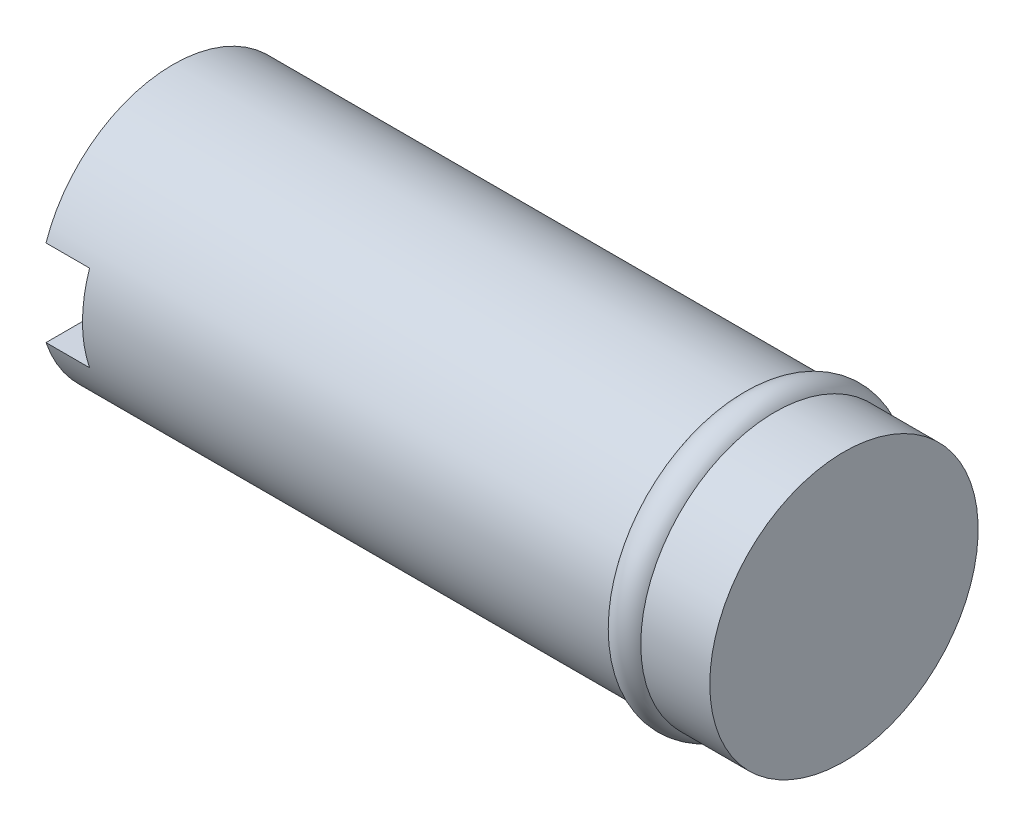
ISO-10303-21;
HEADER;
FILE_DESCRIPTION(('STEP AP214'),'2;1');
FILE_NAME('part.step','',(''),(''),'','','');
FILE_SCHEMA(('AUTOMOTIVE_DESIGN { 1 0 10303 214 1 1 1 1 }'));
ENDSEC;
DATA;
#1=APPLICATION_CONTEXT('core data for automotive mechanical design processes');
#2=APPLICATION_PROTOCOL_DEFINITION('international standard','automotive_design',2000,#1);
#3=PRODUCT_CONTEXT('',#1,'mechanical');
#4=PRODUCT('Part','Part','',(#3));
#5=PRODUCT_RELATED_PRODUCT_CATEGORY('part','',(#4));
#6=PRODUCT_DEFINITION_FORMATION('','',#4);
#7=PRODUCT_DEFINITION_CONTEXT('part definition',#1,'design');
#8=PRODUCT_DEFINITION('design','',#6,#7);
#9=PRODUCT_DEFINITION_SHAPE('','',#8);
#10=(LENGTH_UNIT() NAMED_UNIT(*) SI_UNIT(.MILLI.,.METRE.));
#11=(NAMED_UNIT(*) PLANE_ANGLE_UNIT() SI_UNIT($,.RADIAN.));
#12=(NAMED_UNIT(*) SI_UNIT($,.STERADIAN.) SOLID_ANGLE_UNIT());
#13=UNCERTAINTY_MEASURE_WITH_UNIT(LENGTH_MEASURE(1.E-05),#10,'distance_accuracy_value','');
#14=(GEOMETRIC_REPRESENTATION_CONTEXT(3) GLOBAL_UNCERTAINTY_ASSIGNED_CONTEXT((#13)) GLOBAL_UNIT_ASSIGNED_CONTEXT((#10,
#11,#12)) REPRESENTATION_CONTEXT('',''));
#15=CARTESIAN_POINT('',(0.,0.,0.));
#16=DIRECTION('',(0.,0.,1.));
#17=DIRECTION('',(1.,0.,0.));
#18=AXIS2_PLACEMENT_3D('',#15,#16,#17);
#19=CARTESIAN_POINT('',(0.,0.,0.));
#20=DIRECTION('',(1.,0.,0.));
#21=DIRECTION('',(0.,0.,-1.));
#22=AXIS2_PLACEMENT_3D('',#19,#20,#21);
#23=PLANE('',#22);
#24=CARTESIAN_POINT('',(0.,0.,0.));
#25=DIRECTION('',(-1.,0.,0.));
#26=DIRECTION('',(0.,0.,1.));
#27=AXIS2_PLACEMENT_3D('',#24,#25,#26);
#28=CIRCLE('',#27,3.);
#29=CARTESIAN_POINT('',(0.,-0.964181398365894,-2.84083688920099));
#30=VERTEX_POINT('',#29);
#31=CARTESIAN_POINT('',(0.,-0.964181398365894,2.84083688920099));
#32=VERTEX_POINT('',#31);
#33=EDGE_CURVE('E81',#30,#32,#28,.T.);
#34=ORIENTED_EDGE('',*,*,#33,.T.);
#35=DIRECTION('',(0.,0.,-1.));
#36=VECTOR('',#35,1.);
#37=CARTESIAN_POINT('',(0.,-0.964181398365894,0.));
#38=LINE('',#37,#36);
#39=EDGE_CURVE('E39',#32,#30,#38,.T.);
#40=ORIENTED_EDGE('',*,*,#39,.T.);
#41=EDGE_LOOP('',(#34,#40));
#42=FACE_BOUND('',#41,.T.);
#43=ADVANCED_FACE('F16',(#42),#23,.F.);
#44=CARTESIAN_POINT('',(0.,0.964181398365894,2.84083688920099));
#45=VERTEX_POINT('',#44);
#46=CARTESIAN_POINT('',(0.,0.964181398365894,-2.84083688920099));
#47=VERTEX_POINT('',#46);
#48=EDGE_CURVE('E80',#45,#47,#28,.T.);
#49=ORIENTED_EDGE('',*,*,#48,.T.);
#50=DIRECTION('',(0.,0.,1.));
#51=VECTOR('',#50,1.);
#52=CARTESIAN_POINT('',(0.,0.964181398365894,0.));
#53=LINE('',#52,#51);
#54=EDGE_CURVE('E58',#47,#45,#53,.T.);
#55=ORIENTED_EDGE('',*,*,#54,.T.);
#56=EDGE_LOOP('',(#49,#55));
#57=FACE_BOUND('',#56,.T.);
#58=ADVANCED_FACE('F18',(#57),#23,.F.);
#59=CARTESIAN_POINT('',(0.,0.,0.));
#60=DIRECTION('',(-1.,0.,0.));
#61=DIRECTION('',(0.,0.,1.));
#62=AXIS2_PLACEMENT_3D('',#59,#60,#61);
#63=CYLINDRICAL_SURFACE('',#62,3.);
#64=ORIENTED_EDGE('',*,*,#33,.F.);
#65=DIRECTION('',(-1.,0.,0.));
#66=VECTOR('',#65,1.);
#67=CARTESIAN_POINT('',(0.,-0.964181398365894,-2.84083688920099));
#68=LINE('',#67,#66);
#69=CARTESIAN_POINT('',(0.974420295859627,-0.964181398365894,-2.84083688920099));
#70=VERTEX_POINT('',#69);
#71=EDGE_CURVE('E10',#30,#70,#68,.F.);
#72=ORIENTED_EDGE('',*,*,#71,.T.);
#73=CARTESIAN_POINT('',(0.974420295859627,0.,0.));
#74=DIRECTION('',(1.,0.,0.));
#75=DIRECTION('',(0.,0.,-1.));
#76=AXIS2_PLACEMENT_3D('',#73,#74,#75);
#77=CIRCLE('',#76,3.);
#78=CARTESIAN_POINT('',(0.974420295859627,0.964181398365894,-2.84083688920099));
#79=VERTEX_POINT('',#78);
#80=EDGE_CURVE('E24',#70,#79,#77,.T.);
#81=ORIENTED_EDGE('',*,*,#80,.T.);
#82=DIRECTION('',(-1.,0.,0.));
#83=VECTOR('',#82,1.);
#84=CARTESIAN_POINT('',(0.,0.964181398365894,-2.84083688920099));
#85=LINE('',#84,#83);
#86=EDGE_CURVE('E55',#79,#47,#85,.T.);
#87=ORIENTED_EDGE('',*,*,#86,.T.);
#88=ORIENTED_EDGE('',*,*,#48,.F.);
#89=DIRECTION('',(-1.,0.,0.));
#90=VECTOR('',#89,1.);
#91=CARTESIAN_POINT('',(0.,0.964181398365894,2.84083688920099));
#92=LINE('',#91,#90);
#93=CARTESIAN_POINT('',(0.974420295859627,0.964181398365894,2.84083688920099));
#94=VERTEX_POINT('',#93);
#95=EDGE_CURVE('E79',#45,#94,#92,.F.);
#96=ORIENTED_EDGE('',*,*,#95,.T.);
#97=CARTESIAN_POINT('',(0.974420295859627,-0.964181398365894,2.84083688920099));
#98=VERTEX_POINT('',#97);
#99=EDGE_CURVE('E69',#94,#98,#77,.T.);
#100=ORIENTED_EDGE('',*,*,#99,.T.);
#101=DIRECTION('',(-1.,0.,0.));
#102=VECTOR('',#101,1.);
#103=CARTESIAN_POINT('',(0.,-0.964181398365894,2.84083688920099));
#104=LINE('',#103,#102);
#105=EDGE_CURVE('E63',#98,#32,#104,.T.);
#106=ORIENTED_EDGE('',*,*,#105,.T.);
#107=EDGE_LOOP('',(#64,#72,#81,#87,#88,#96,#100,#106));
#108=FACE_BOUND('',#107,.T.);
#109=CARTESIAN_POINT('',(12.7392093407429,0.,0.));
#110=DIRECTION('',(-1.,0.,0.));
#111=DIRECTION('',(0.,0.,1.));
#112=AXIS2_PLACEMENT_3D('',#109,#110,#111);
#113=CIRCLE('',#112,3.);
#114=CARTESIAN_POINT('',(12.7392093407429,0.,3.));
#115=VERTEX_POINT('',#114);
#116=EDGE_CURVE('E84',#115,#115,#113,.T.);
#117=ORIENTED_EDGE('',*,*,#116,.T.);
#118=EDGE_LOOP('',(#117));
#119=FACE_BOUND('',#118,.T.);
#120=ADVANCED_FACE('F74',(#108,#119),#63,.T.);
#121=CARTESIAN_POINT('',(13.0981836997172,0.,0.));
#122=DIRECTION('',(-1.,0.,0.));
#123=DIRECTION('',(0.,0.,1.));
#124=AXIS2_PLACEMENT_3D('',#121,#122,#123);
#125=TOROIDAL_SURFACE('',#124,2.75215608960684,0.43622149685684);
#126=ORIENTED_EDGE('',*,*,#116,.F.);
#127=EDGE_LOOP('',(#126));
#128=FACE_BOUND('',#127,.T.);
#129=CARTESIAN_POINT('',(13.4571580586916,0.,0.));
#130=DIRECTION('',(-1.,0.,0.));
#131=DIRECTION('',(0.,0.,1.));
#132=AXIS2_PLACEMENT_3D('',#129,#130,#131);
#133=CIRCLE('',#132,3.);
#134=CARTESIAN_POINT('',(13.4571580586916,0.,3.));
#135=VERTEX_POINT('',#134);
#136=EDGE_CURVE('E87',#135,#135,#133,.T.);
#137=ORIENTED_EDGE('',*,*,#136,.T.);
#138=EDGE_LOOP('',(#137));
#139=FACE_BOUND('',#138,.T.);
#140=ADVANCED_FACE('F109',(#128,#139),#125,.T.);
#141=CARTESIAN_POINT('',(0.,0.,0.));
#142=DIRECTION('',(-1.,0.,0.));
#143=DIRECTION('',(0.,0.,1.));
#144=AXIS2_PLACEMENT_3D('',#141,#142,#143);
#145=CYLINDRICAL_SURFACE('',#144,3.);
#146=ORIENTED_EDGE('',*,*,#136,.F.);
#147=EDGE_LOOP('',(#146));
#148=FACE_BOUND('',#147,.T.);
#149=CARTESIAN_POINT('',(15.,0.,0.));
#150=DIRECTION('',(-1.,0.,0.));
#151=DIRECTION('',(0.,0.,1.));
#152=AXIS2_PLACEMENT_3D('',#149,#150,#151);
#153=CIRCLE('',#152,3.);
#154=CARTESIAN_POINT('',(15.,0.,3.));
#155=VERTEX_POINT('',#154);
#156=EDGE_CURVE('E90',#155,#155,#153,.T.);
#157=ORIENTED_EDGE('',*,*,#156,.T.);
#158=EDGE_LOOP('',(#157));
#159=FACE_BOUND('',#158,.T.);
#160=ADVANCED_FACE('F114',(#148,#159),#145,.T.);
#161=CARTESIAN_POINT('',(15.,3.,0.));
#162=DIRECTION('',(-1.,0.,0.));
#163=DIRECTION('',(0.,0.,1.));
#164=AXIS2_PLACEMENT_3D('',#161,#162,#163);
#165=PLANE('',#164);
#166=ORIENTED_EDGE('',*,*,#156,.F.);
#167=EDGE_LOOP('',(#166));
#168=FACE_BOUND('',#167,.T.);
#169=ADVANCED_FACE('F120',(#168),#165,.F.);
#170=CARTESIAN_POINT('',(0.974420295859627,-0.964181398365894,-3.18837758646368));
#171=DIRECTION('',(1.,0.,0.));
#172=DIRECTION('',(0.,0.,-1.));
#173=AXIS2_PLACEMENT_3D('',#170,#171,#172);
#174=PLANE('',#173);
#175=DIRECTION('',(0.,0.,1.));
#176=VECTOR('',#175,1.);
#177=CARTESIAN_POINT('',(0.974420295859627,0.964181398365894,-3.18837758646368));
#178=LINE('',#177,#176);
#179=EDGE_CURVE('E31',#79,#94,#178,.T.);
#180=ORIENTED_EDGE('',*,*,#179,.F.);
#181=ORIENTED_EDGE('',*,*,#80,.F.);
#182=DIRECTION('',(0.,0.,1.));
#183=VECTOR('',#182,1.);
#184=CARTESIAN_POINT('',(0.974420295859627,-0.964181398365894,-3.18837758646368));
#185=LINE('',#184,#183);
#186=EDGE_CURVE('E71',#70,#98,#185,.T.);
#187=ORIENTED_EDGE('',*,*,#186,.T.);
#188=ORIENTED_EDGE('',*,*,#99,.F.);
#189=EDGE_LOOP('',(#180,#181,#187,#188));
#190=FACE_BOUND('',#189,.T.);
#191=ADVANCED_FACE('F65',(#190),#174,.F.);
#192=CARTESIAN_POINT('',(-0.974420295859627,-0.964181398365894,-3.18837758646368));
#193=DIRECTION('',(0.,-1.,0.));
#194=DIRECTION('',(0.,0.,-1.));
#195=AXIS2_PLACEMENT_3D('',#192,#193,#194);
#196=PLANE('',#195);
#197=ORIENTED_EDGE('',*,*,#186,.F.);
#198=ORIENTED_EDGE('',*,*,#71,.F.);
#199=ORIENTED_EDGE('',*,*,#39,.F.);
#200=ORIENTED_EDGE('',*,*,#105,.F.);
#201=EDGE_LOOP('',(#197,#198,#199,#200));
#202=FACE_BOUND('',#201,.T.);
#203=ADVANCED_FACE('F95',(#202),#196,.F.);
#204=CARTESIAN_POINT('',(-0.974420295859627,0.964181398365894,-3.18837758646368));
#205=DIRECTION('',(0.,1.,0.));
#206=DIRECTION('',(0.,0.,1.));
#207=AXIS2_PLACEMENT_3D('',#204,#205,#206);
#208=PLANE('',#207);
#209=ORIENTED_EDGE('',*,*,#179,.T.);
#210=ORIENTED_EDGE('',*,*,#95,.F.);
#211=ORIENTED_EDGE('',*,*,#54,.F.);
#212=ORIENTED_EDGE('',*,*,#86,.F.);
#213=EDGE_LOOP('',(#209,#210,#211,#212));
#214=FACE_BOUND('',#213,.T.);
#215=ADVANCED_FACE('F56',(#214),#208,.F.);
#216=CLOSED_SHELL('',(#43,#58,#120,#140,#160,#169,#191,#203,#215));
#217=MANIFOLD_SOLID_BREP('B1',#216);
#218=ADVANCED_BREP_SHAPE_REPRESENTATION('',(#18,#217),#14);
#219=SHAPE_DEFINITION_REPRESENTATION(#9,#218);
ENDSEC;
END-ISO-10303-21;
